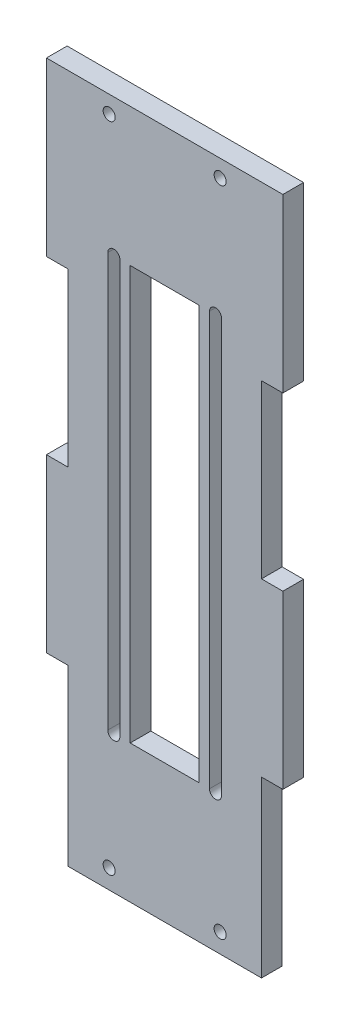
from build123d import *

# Parameters (mm, degrees)
CROQUIS1_R              = 1.75
CROQUIS1_W              = 20
CROQUIS1_H              = 120
SALIENTE_EXTRUIR1_DEPTH = 6


with BuildPart() as part:
    # Croquis1 → Saliente-Extruir1 (new body)
    with BuildSketch(Plane.XY):
        Polygon((0, 0), (56.2, 0), (56.2, 50.5), (62.4, 50.5), (62.4, 100.3), (56.2, 100.3), (56.2, 150.1), (62.4, 150.1), (62.4, 200), (56.2, 200), (0, 200), (-6.2, 200), (-6.2, 150.1), (0, 150.1), (0, 100.3), (-6.2, 100.3), (-6.2, 50.5), (0, 50.5), align=None)
        with Locations((12, 195)):
            Circle(CROQUIS1_R, mode=Mode.SUBTRACT)
        with Locations(Location((44.2, 195, 0), (0, 0, 180))):
            Circle(CROQUIS1_R, mode=Mode.SUBTRACT)
        with Locations(Location((12, 5.6, 0), (0, 0, 180))):
            Circle(CROQUIS1_R, mode=Mode.SUBTRACT)
        with Locations((44.2, 5.6)):
            Circle(CROQUIS1_R, mode=Mode.SUBTRACT)
        with BuildLine():
            Line((41.1, 160), (41.1, 40))
            ThreePointArc((41.1, 40), (42.85, 38.25), (44.6, 40))
            Line((44.6, 40), (44.6, 160))
            ThreePointArc((44.6, 160), (42.85, 161.75), (41.1, 160))
        make_face(mode=Mode.SUBTRACT)
        with Locations((28.1, 100)):
            Rectangle(CROQUIS1_W, CROQUIS1_H, mode=Mode.SUBTRACT)
        with BuildLine():
            Line((15.1, 160), (15.1, 40))
            ThreePointArc((15.1, 40), (13.35, 38.25), (11.6, 40))
            Line((11.6, 40), (11.6, 160))
            ThreePointArc((11.6, 160), (13.35, 161.75), (15.1, 160))
        make_face(mode=Mode.SUBTRACT)
    extrude(amount=SALIENTE_EXTRUIR1_DEPTH)


solid = part.part
